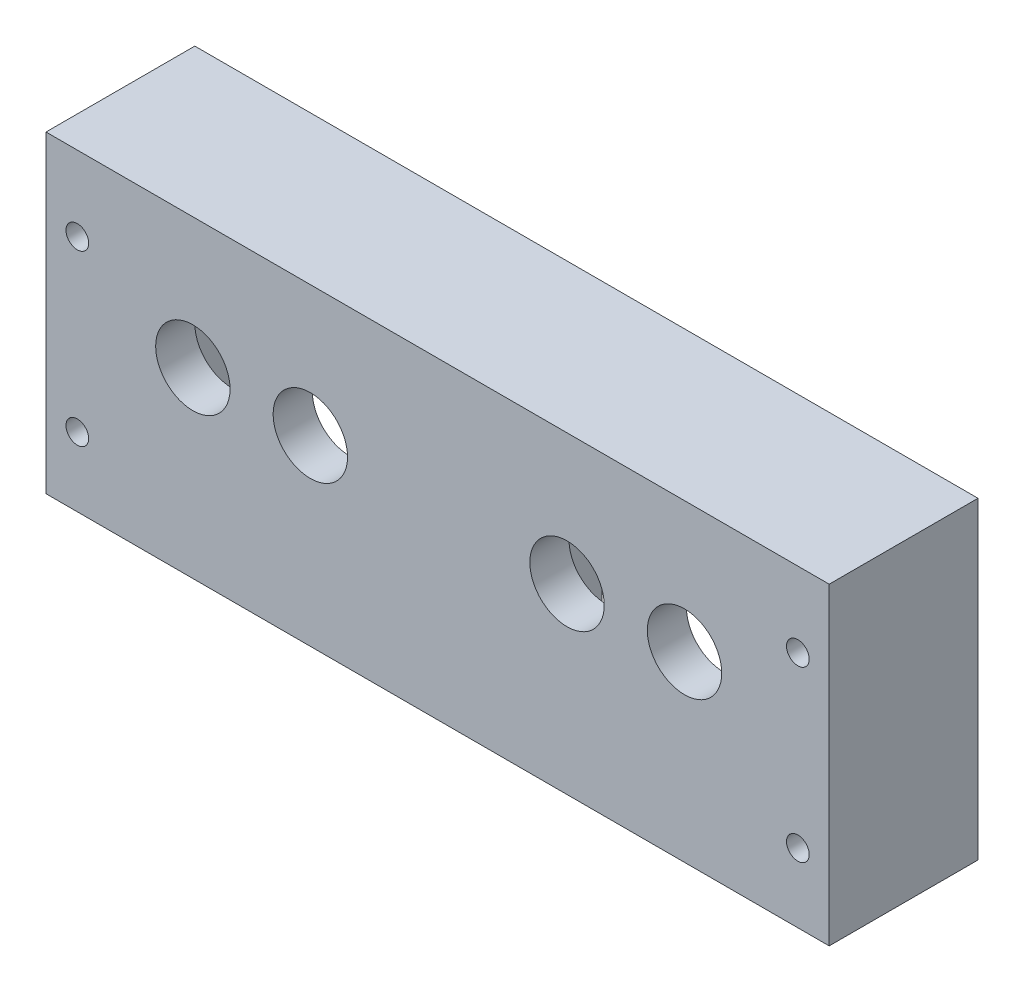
from build123d import *

# Parameters (mm, degrees)
SKETCH1_W           = 100
SKETCH1_H           = 40
BOSS_EXTRUDE1_DEPTH = 38
CUT_EXTRUDE2_START  = -12
SKETCH2_W           = 39.5
SKETCH2_H           = 34
CUT_EXTRUDE2_DEPTH  = 21
CUT_EXTRUDE3_DEPTH  = 9
CUT_EXTRUDE4_REACH  = 81.36
SKETCH4_R           = 1.45
SKETCH5_W           = 100
SKETCH5_H           = 19
CUT_EXTRUDE5_DEPTH  = 87.215210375
FILLET1_R           = 0.5
CUT_EXTRUDE9_START  = 13.5
CUT_EXTRUDE9_DEPTH  = 0.5
CUT_EXTRUDE9_TAPER  = 2
CUT_EXTRUDE10_START = 13.5
CUT_EXTRUDE10_DEPTH = 0.5
CUT_EXTRUDE10_TAPER = 2
CUT_EXTRUDE11_REACH = 73.063
SKETCH10_R          = 4.75


with BuildPart() as part:
    # Sketch1 → Boss-Extrude1 (new body)
    with BuildSketch(Plane.XY):
        with Locations((16.25, 1.5625)):
            Rectangle(SKETCH1_W, SKETCH1_H)
    extrude(amount=BOSS_EXTRUDE1_DEPTH)

    # Sketch2 → Cut-Extrude2 (cut)
    with BuildSketch(Plane(origin=(0, 0, 0), x_dir=(-1, 0, 0), z_dir=(0, 0, -1)).offset(CUT_EXTRUDE2_START)):
        with Locations((-38.5, 1.5625)):
            Rectangle(SKETCH2_W, SKETCH2_H)
        with Locations((6, 1.5625)):
            Rectangle(SKETCH2_W, SKETCH2_H)
    extrude(amount=-CUT_EXTRUDE2_DEPTH, mode=Mode.SUBTRACT)

    # Sketch3 → Cut-Extrude3 (cut)
    with BuildSketch(Plane(origin=(-3.362318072, 0, 0), x_dir=(-1, 0, 0), z_dir=(0, 0, -1))):
        with BuildLine():
            ThreePointArc((-61.593370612, 1.614325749), (-20.676836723, -17.421621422), (21.715969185, -1.949710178))
            ThreePointArc((21.715969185, -1.949710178), (22.204299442, 9.465009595), (10.78957967, 9.953339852))
            ThreePointArc((10.78957967, 9.953339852), (-19.986233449, -1.278769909), (-49.690320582, 12.540715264))
            ThreePointArc((-49.690320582, 12.540715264), (-61.105040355, 13.029045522), (-61.593370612, 1.614325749))
        make_face()
    extrude(amount=-CUT_EXTRUDE3_DEPTH, mode=Mode.SUBTRACT)

    # Sketch4 → Cut-Extrude4 (cut, up to next)
    with BuildSketch(Plane(origin=(0, 0, 0), x_dir=(-1, 0, 0), z_dir=(0, 0, -1)), mode=Mode.PRIVATE) as cut_extrude4_sk1:
        with Locations((-62.25, 11.98479819)):
            Circle(SKETCH4_R)
    cut_extrude4_tool1 = extrude(cut_extrude4_sk1.sketch, amount=-CUT_EXTRUDE4_REACH, mode=Mode.PRIVATE) & part.part
    # Sketch4 → Cut-Extrude4 (cut, up to next)
    with BuildSketch(Plane(origin=(0, 0, 0), x_dir=(-1, 0, 0), z_dir=(0, 0, -1)), mode=Mode.PRIVATE) as cut_extrude4_sk2:
        with Locations((-62.25, -9.616561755)):
            Circle(SKETCH4_R)
    cut_extrude4_tool2 = extrude(cut_extrude4_sk2.sketch, amount=-CUT_EXTRUDE4_REACH, mode=Mode.PRIVATE) & part.part
    # Sketch4 → Cut-Extrude4 (cut, up to next)
    with BuildSketch(Plane(origin=(0, 0, 0), x_dir=(-1, 0, 0), z_dir=(0, 0, -1)), mode=Mode.PRIVATE) as cut_extrude4_sk3:
        with Locations((29.75, 11.98479819)):
            Circle(SKETCH4_R)
    cut_extrude4_tool3 = extrude(cut_extrude4_sk3.sketch, amount=-CUT_EXTRUDE4_REACH, mode=Mode.PRIVATE) & part.part
    # Sketch4 → Cut-Extrude4 (cut, up to next)
    with BuildSketch(Plane(origin=(0, 0, 0), x_dir=(-1, 0, 0), z_dir=(0, 0, -1)), mode=Mode.PRIVATE) as cut_extrude4_sk4:
        with Locations((29.75, -9.616561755)):
            Circle(SKETCH4_R)
    cut_extrude4_tool4 = extrude(cut_extrude4_sk4.sketch, amount=-CUT_EXTRUDE4_REACH, mode=Mode.PRIVATE) & part.part
    add(cut_extrude4_tool1.solids().sort_by_distance((62.25, 11.984798, 0))[0], mode=Mode.SUBTRACT)
    add(cut_extrude4_tool2.solids().sort_by_distance((62.25, -9.616562, 0))[0], mode=Mode.SUBTRACT)
    add(cut_extrude4_tool3.solids().sort_by_distance((-29.75, 11.984798, 0))[0], mode=Mode.SUBTRACT)
    add(cut_extrude4_tool4.solids().sort_by_distance((-29.75, -9.616562, 0))[0], mode=Mode.SUBTRACT)

    # Sketch5 → Cut-Extrude5 (cut, through all)
    with BuildSketch(Plane(origin=(0, 21.5625, 0), x_dir=(1, 0, 0), z_dir=(0, 1, 0))):
        with Locations((16.25, -9.5)):
            Rectangle(SKETCH5_W, SKETCH5_H)
    extrude(amount=-CUT_EXTRUDE5_DEPTH, mode=Mode.SUBTRACT)

    # Fillet1
    fillet1_edges = [part.edges().sort_by_distance(p)[0] for p in [
        (58.25, 18.5625, 26),
        (18.75, 18.5625, 26),
        (18.75, -15.4375, 26),
        (58.25, -15.4375, 26),
        (13.75, 18.5625, 26),
        (-25.75, 18.5625, 26),
        (-25.75, -15.4375, 26),
        (13.75, -15.4375, 26),
    ]]
    fillet(fillet1_edges, radius=FILLET1_R)

    # Sketch8 → Cut-Extrude9 (cut)
    with BuildSketch(Plane(origin=(0, 0, 33), x_dir=(-1, 0, 0), z_dir=(0, 0, -1)).offset(CUT_EXTRUDE9_START)):
        with BuildLine():
            Line((-18.25, -14.9375), (-18.25, 18.0625))
            ThreePointArc((-18.25, 18.0625), (-18.542893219, 18.769606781), (-19.25, 19.0625))
            Line((-19.25, 19.0625), (-57.75, 19.0625))
            ThreePointArc((-57.75, 19.0625), (-58.457106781, 18.769606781), (-58.75, 18.0625))
            Line((-58.75, 18.0625), (-58.75, -14.9375))
            ThreePointArc((-58.75, -14.9375), (-58.457106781, -15.644606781), (-57.75, -15.9375))
            Line((-57.75, -15.9375), (-19.25, -15.9375))
            ThreePointArc((-19.25, -15.9375), (-18.542893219, -15.644606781), (-18.25, -14.9375))
        make_face()
    extrude(amount=CUT_EXTRUDE9_DEPTH, taper=CUT_EXTRUDE9_TAPER, mode=Mode.SUBTRACT)

    # Sketch9 → Cut-Extrude10 (cut)
    with BuildSketch(Plane(origin=(0, 0, 33), x_dir=(-1, 0, 0), z_dir=(0, 0, -1)).offset(CUT_EXTRUDE10_START)):
        with BuildLine():
            Line((-14.25, 18.0625), (-14.25, -14.9375))
            ThreePointArc((-14.25, -14.9375), (-13.957106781, -15.644606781), (-13.25, -15.9375))
            Line((-13.25, -15.9375), (25.25, -15.9375))
            ThreePointArc((25.25, -15.9375), (25.957106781, -15.644606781), (26.25, -14.9375))
            Line((26.25, -14.9375), (26.25, 18.0625))
            ThreePointArc((26.25, 18.0625), (25.957106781, 18.769606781), (25.25, 19.0625))
            Line((25.25, 19.0625), (-13.25, 19.0625))
            ThreePointArc((-13.25, 19.0625), (-13.957106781, 18.769606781), (-14.25, 18.0625))
        make_face()
    extrude(amount=CUT_EXTRUDE10_DEPTH, taper=CUT_EXTRUDE10_TAPER, mode=Mode.SUBTRACT)

    # Sketch10 → Cut-Extrude11 (cut, up to next)
    with BuildSketch(Plane(origin=(0, 0, 33), x_dir=(-1, 0, 0), z_dir=(0, 0, -1)), mode=Mode.PRIVATE) as cut_extrude11_sk1:
        with Locations((-47.777200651, 4.85170637)):
            Circle(SKETCH10_R)
    cut_extrude11_tool1 = extrude(cut_extrude11_sk1.sketch, amount=-CUT_EXTRUDE11_REACH, mode=Mode.PRIVATE) & part.part
    # Sketch10 → Cut-Extrude11 (cut, up to next)
    with BuildSketch(Plane(origin=(0, 0, 33), x_dir=(-1, 0, 0), z_dir=(0, 0, -1)), mode=Mode.PRIVATE) as cut_extrude11_sk2:
        with Locations((-32.777211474, 4.869725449)):
            Circle(SKETCH10_R)
    cut_extrude11_tool2 = extrude(cut_extrude11_sk2.sketch, amount=-CUT_EXTRUDE11_REACH, mode=Mode.PRIVATE) & part.part
    # Sketch10 → Cut-Extrude11 (cut, up to next)
    with BuildSketch(Plane(origin=(0, 0, 33), x_dir=(-1, 0, 0), z_dir=(0, 0, -1)), mode=Mode.PRIVATE) as cut_extrude11_sk3:
        with Locations((0, 4.87445836)):
            Circle(SKETCH10_R)
    cut_extrude11_tool3 = extrude(cut_extrude11_sk3.sketch, amount=-CUT_EXTRUDE11_REACH, mode=Mode.PRIVATE) & part.part
    # Sketch10 → Cut-Extrude11 (cut, up to next)
    with BuildSketch(Plane(origin=(0, 0, 33), x_dir=(-1, 0, 0), z_dir=(0, 0, -1)), mode=Mode.PRIVATE) as cut_extrude11_sk4:
        with Locations((15, 4.87445836)):
            Circle(SKETCH10_R)
    cut_extrude11_tool4 = extrude(cut_extrude11_sk4.sketch, amount=-CUT_EXTRUDE11_REACH, mode=Mode.PRIVATE) & part.part
    add(cut_extrude11_tool1.solids().sort_by_distance((47.777201, 4.851706, 33))[0], mode=Mode.SUBTRACT)
    add(cut_extrude11_tool2.solids().sort_by_distance((32.777211, 4.869725, 33))[0], mode=Mode.SUBTRACT)
    add(cut_extrude11_tool3.solids().sort_by_distance((0, 4.874458, 33))[0], mode=Mode.SUBTRACT)
    add(cut_extrude11_tool4.solids().sort_by_distance((-15, 4.874458, 33))[0], mode=Mode.SUBTRACT)


solid = part.part
